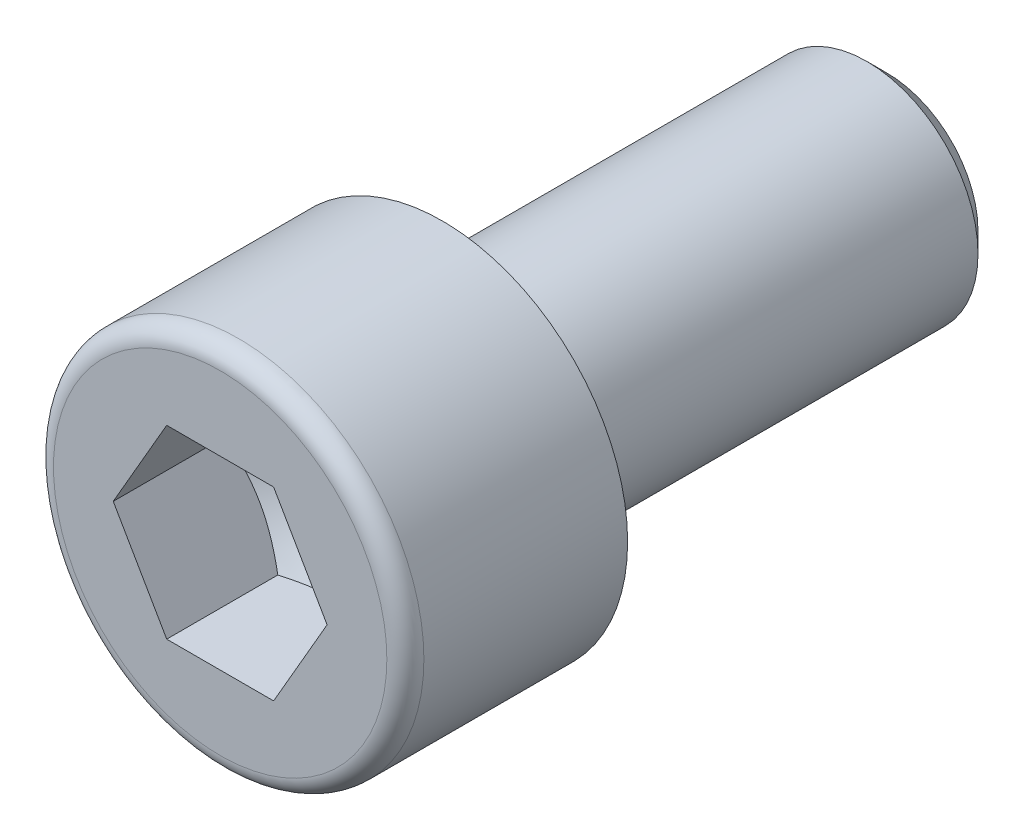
ISO-10303-21;
HEADER;
FILE_DESCRIPTION(('STEP AP214'),'2;1');
FILE_NAME('part.step','',(''),(''),'','','');
FILE_SCHEMA(('AUTOMOTIVE_DESIGN { 1 0 10303 214 1 1 1 1 }'));
ENDSEC;
DATA;
#1=APPLICATION_CONTEXT('core data for automotive mechanical design processes');
#2=APPLICATION_PROTOCOL_DEFINITION('international standard','automotive_design',2000,#1);
#3=PRODUCT_CONTEXT('',#1,'mechanical');
#4=PRODUCT('Part','Part','',(#3));
#5=PRODUCT_RELATED_PRODUCT_CATEGORY('part','',(#4));
#6=PRODUCT_DEFINITION_FORMATION('','',#4);
#7=PRODUCT_DEFINITION_CONTEXT('part definition',#1,'design');
#8=PRODUCT_DEFINITION('design','',#6,#7);
#9=PRODUCT_DEFINITION_SHAPE('','',#8);
#10=(LENGTH_UNIT() NAMED_UNIT(*) SI_UNIT(.MILLI.,.METRE.));
#11=(NAMED_UNIT(*) PLANE_ANGLE_UNIT() SI_UNIT($,.RADIAN.));
#12=(NAMED_UNIT(*) SI_UNIT($,.STERADIAN.) SOLID_ANGLE_UNIT());
#13=UNCERTAINTY_MEASURE_WITH_UNIT(LENGTH_MEASURE(1.E-05),#10,'distance_accuracy_value','');
#14=(GEOMETRIC_REPRESENTATION_CONTEXT(3) GLOBAL_UNCERTAINTY_ASSIGNED_CONTEXT((#13)) GLOBAL_UNIT_ASSIGNED_CONTEXT((#10,
#11,#12)) REPRESENTATION_CONTEXT('',''));
#15=CARTESIAN_POINT('',(0.,0.,0.));
#16=DIRECTION('',(0.,0.,1.));
#17=DIRECTION('',(1.,0.,0.));
#18=AXIS2_PLACEMENT_3D('',#15,#16,#17);
#19=CARTESIAN_POINT('',(0.,0.,6.));
#20=DIRECTION('',(0.,0.,1.));
#21=DIRECTION('',(1.,0.,0.));
#22=AXIS2_PLACEMENT_3D('',#19,#20,#21);
#23=PLANE('',#22);
#24=CARTESIAN_POINT('',(0.,0.,6.));
#25=DIRECTION('',(0.,0.,1.));
#26=DIRECTION('',(1.,0.,0.));
#27=AXIS2_PLACEMENT_3D('',#24,#25,#26);
#28=CIRCLE('',#27,4.5);
#29=CARTESIAN_POINT('',(4.5,0.,6.));
#30=VERTEX_POINT('',#29);
#31=EDGE_CURVE('E11',#30,#30,#28,.T.);
#32=ORIENTED_EDGE('',*,*,#31,.T.);
#33=EDGE_LOOP('',(#32));
#34=FACE_BOUND('',#33,.T.);
#35=DIRECTION('',(1.,0.,0.));
#36=VECTOR('',#35,1.);
#37=CARTESIAN_POINT('',(-1.443375,2.49999883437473,6.));
#38=LINE('',#37,#36);
#39=CARTESIAN_POINT('',(-1.443375,2.49999883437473,6.));
#40=VERTEX_POINT('',#39);
#41=CARTESIAN_POINT('',(1.443375,2.49999883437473,6.));
#42=VERTEX_POINT('',#41);
#43=EDGE_CURVE('E91',#40,#42,#38,.T.);
#44=ORIENTED_EDGE('',*,*,#43,.T.);
#45=DIRECTION('',(0.5,-0.866025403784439,0.));
#46=VECTOR('',#45,1.);
#47=CARTESIAN_POINT('',(1.443375,2.49999883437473,6.));
#48=LINE('',#47,#46);
#49=CARTESIAN_POINT('',(2.88675,0.,6.));
#50=VERTEX_POINT('',#49);
#51=EDGE_CURVE('E30',#42,#50,#48,.T.);
#52=ORIENTED_EDGE('',*,*,#51,.T.);
#53=DIRECTION('',(-0.5,-0.866025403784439,0.));
#54=VECTOR('',#53,1.);
#55=CARTESIAN_POINT('',(2.88675,0.,6.));
#56=LINE('',#55,#54);
#57=CARTESIAN_POINT('',(1.443375,-2.49999883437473,6.));
#58=VERTEX_POINT('',#57);
#59=EDGE_CURVE('E171',#50,#58,#56,.T.);
#60=ORIENTED_EDGE('',*,*,#59,.T.);
#61=DIRECTION('',(-1.,0.,0.));
#62=VECTOR('',#61,1.);
#63=CARTESIAN_POINT('',(1.443375,-2.49999883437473,6.));
#64=LINE('',#63,#62);
#65=CARTESIAN_POINT('',(-1.443375,-2.49999883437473,6.));
#66=VERTEX_POINT('',#65);
#67=EDGE_CURVE('E167',#58,#66,#64,.T.);
#68=ORIENTED_EDGE('',*,*,#67,.T.);
#69=DIRECTION('',(-0.5,0.866025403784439,0.));
#70=VECTOR('',#69,1.);
#71=CARTESIAN_POINT('',(-1.443375,-2.49999883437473,6.));
#72=LINE('',#71,#70);
#73=CARTESIAN_POINT('',(-2.88675,0.,6.));
#74=VERTEX_POINT('',#73);
#75=EDGE_CURVE('E162',#66,#74,#72,.T.);
#76=ORIENTED_EDGE('',*,*,#75,.T.);
#77=DIRECTION('',(0.5,0.866025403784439,0.));
#78=VECTOR('',#77,1.);
#79=CARTESIAN_POINT('',(-2.88675,0.,6.));
#80=LINE('',#79,#78);
#81=EDGE_CURVE('E95',#74,#40,#80,.T.);
#82=ORIENTED_EDGE('',*,*,#81,.T.);
#83=EDGE_LOOP('',(#44,#52,#60,#68,#76,#82));
#84=FACE_BOUND('',#83,.T.);
#85=ADVANCED_FACE('F16',(#34,#84),#23,.T.);
#86=CARTESIAN_POINT('',(0.,0.,5.5));
#87=DIRECTION('',(0.,0.,1.));
#88=DIRECTION('',(1.,0.,0.));
#89=AXIS2_PLACEMENT_3D('',#86,#87,#88);
#90=TOROIDAL_SURFACE('',#89,4.5,0.5);
#91=ORIENTED_EDGE('',*,*,#31,.F.);
#92=EDGE_LOOP('',(#91));
#93=FACE_BOUND('',#92,.T.);
#94=CARTESIAN_POINT('',(0.,0.,5.5));
#95=DIRECTION('',(0.,0.,1.));
#96=DIRECTION('',(1.,0.,0.));
#97=AXIS2_PLACEMENT_3D('',#94,#95,#96);
#98=CIRCLE('',#97,5.);
#99=CARTESIAN_POINT('',(5.,0.,5.5));
#100=VERTEX_POINT('',#99);
#101=EDGE_CURVE('E23',#100,#100,#98,.T.);
#102=ORIENTED_EDGE('',*,*,#101,.T.);
#103=EDGE_LOOP('',(#102));
#104=FACE_BOUND('',#103,.T.);
#105=ADVANCED_FACE('F132',(#93,#104),#90,.T.);
#106=CARTESIAN_POINT('',(0.,0.,6.));
#107=DIRECTION('',(0.,0.,1.));
#108=DIRECTION('',(1.,0.,0.));
#109=AXIS2_PLACEMENT_3D('',#106,#107,#108);
#110=CYLINDRICAL_SURFACE('',#109,5.);
#111=CARTESIAN_POINT('',(0.,0.,0.));
#112=DIRECTION('',(0.,0.,1.));
#113=DIRECTION('',(1.,0.,0.));
#114=AXIS2_PLACEMENT_3D('',#111,#112,#113);
#115=CIRCLE('',#114,5.);
#116=CARTESIAN_POINT('',(5.,0.,0.));
#117=VERTEX_POINT('',#116);
#118=EDGE_CURVE('E127',#117,#117,#115,.T.);
#119=ORIENTED_EDGE('',*,*,#118,.T.);
#120=EDGE_LOOP('',(#119));
#121=FACE_BOUND('',#120,.T.);
#122=ORIENTED_EDGE('',*,*,#101,.F.);
#123=EDGE_LOOP('',(#122));
#124=FACE_BOUND('',#123,.T.);
#125=ADVANCED_FACE('F134',(#121,#124),#110,.T.);
#126=CARTESIAN_POINT('',(0.,5.,0.));
#127=DIRECTION('',(0.,0.,-1.));
#128=DIRECTION('',(-1.,0.,0.));
#129=AXIS2_PLACEMENT_3D('',#126,#127,#128);
#130=PLANE('',#129);
#131=CARTESIAN_POINT('',(0.,0.,0.));
#132=DIRECTION('',(0.,0.,1.));
#133=DIRECTION('',(1.,0.,0.));
#134=AXIS2_PLACEMENT_3D('',#131,#132,#133);
#135=CIRCLE('',#134,3.3);
#136=CARTESIAN_POINT('',(3.3,0.,0.));
#137=VERTEX_POINT('',#136);
#138=EDGE_CURVE('E124',#137,#137,#135,.T.);
#139=ORIENTED_EDGE('',*,*,#138,.T.);
#140=EDGE_LOOP('',(#139));
#141=FACE_BOUND('',#140,.T.);
#142=ORIENTED_EDGE('',*,*,#118,.F.);
#143=EDGE_LOOP('',(#142));
#144=FACE_BOUND('',#143,.T.);
#145=ADVANCED_FACE('F136',(#141,#144),#130,.T.);
#146=CARTESIAN_POINT('',(0.,0.,-0.3));
#147=DIRECTION('',(0.,0.,1.));
#148=DIRECTION('',(1.,0.,0.));
#149=AXIS2_PLACEMENT_3D('',#146,#147,#148);
#150=TOROIDAL_SURFACE('',#149,3.3,0.3);
#151=CARTESIAN_POINT('',(0.,0.,-0.3));
#152=DIRECTION('',(0.,0.,1.));
#153=DIRECTION('',(1.,0.,0.));
#154=AXIS2_PLACEMENT_3D('',#151,#152,#153);
#155=CIRCLE('',#154,3.);
#156=CARTESIAN_POINT('',(3.,0.,-0.3));
#157=VERTEX_POINT('',#156);
#158=EDGE_CURVE('E121',#157,#157,#155,.T.);
#159=ORIENTED_EDGE('',*,*,#158,.T.);
#160=EDGE_LOOP('',(#159));
#161=FACE_BOUND('',#160,.T.);
#162=ORIENTED_EDGE('',*,*,#138,.F.);
#163=EDGE_LOOP('',(#162));
#164=FACE_BOUND('',#163,.T.);
#165=ADVANCED_FACE('F145',(#161,#164),#150,.F.);
#166=CARTESIAN_POINT('',(0.,0.,6.));
#167=DIRECTION('',(0.,0.,1.));
#168=DIRECTION('',(1.,0.,0.));
#169=AXIS2_PLACEMENT_3D('',#166,#167,#168);
#170=CYLINDRICAL_SURFACE('',#169,3.);
#171=CARTESIAN_POINT('',(0.,0.,-0.301));
#172=DIRECTION('',(0.,0.,1.));
#173=DIRECTION('',(1.,0.,0.));
#174=AXIS2_PLACEMENT_3D('',#171,#172,#173);
#175=CIRCLE('',#174,3.);
#176=CARTESIAN_POINT('',(3.,0.,-0.301));
#177=VERTEX_POINT('',#176);
#178=EDGE_CURVE('E118',#177,#177,#175,.T.);
#179=ORIENTED_EDGE('',*,*,#178,.T.);
#180=EDGE_LOOP('',(#179));
#181=FACE_BOUND('',#180,.T.);
#182=ORIENTED_EDGE('',*,*,#158,.F.);
#183=EDGE_LOOP('',(#182));
#184=FACE_BOUND('',#183,.T.);
#185=ADVANCED_FACE('F301',(#181,#184),#170,.T.);
#186=CARTESIAN_POINT('',(0.,0.,-0.301));
#187=DIRECTION('',(0.,0.,1.));
#188=DIRECTION('',(1.,0.,0.));
#189=AXIS2_PLACEMENT_3D('',#186,#187,#188);
#190=CONICAL_SURFACE('',#189,3.,0.523598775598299);
#191=CARTESIAN_POINT('',(0.,0.,-1.23847249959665));
#192=DIRECTION('',(0.,0.,1.));
#193=DIRECTION('',(1.,0.,0.));
#194=AXIS2_PLACEMENT_3D('',#191,#192,#193);
#195=CIRCLE('',#194,2.45875);
#196=CARTESIAN_POINT('',(2.45875,0.,-1.23847249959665));
#197=VERTEX_POINT('',#196);
#198=EDGE_CURVE('E115',#197,#197,#195,.T.);
#199=ORIENTED_EDGE('',*,*,#198,.T.);
#200=EDGE_LOOP('',(#199));
#201=FACE_BOUND('',#200,.T.);
#202=ORIENTED_EDGE('',*,*,#178,.F.);
#203=EDGE_LOOP('',(#202));
#204=FACE_BOUND('',#203,.T.);
#205=ADVANCED_FACE('F314',(#201,#204),#190,.T.);
#206=CARTESIAN_POINT('',(0.,2.45875,-1.23847249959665));
#207=DIRECTION('',(0.,0.,1.));
#208=DIRECTION('',(1.,0.,0.));
#209=AXIS2_PLACEMENT_3D('',#206,#207,#208);
#210=PLANE('',#209);
#211=CARTESIAN_POINT('',(0.,0.,-1.23847249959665));
#212=DIRECTION('',(0.,0.,1.));
#213=DIRECTION('',(1.,0.,0.));
#214=AXIS2_PLACEMENT_3D('',#211,#212,#213);
#215=CIRCLE('',#214,3.);
#216=CARTESIAN_POINT('',(3.,0.,-1.23847249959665));
#217=VERTEX_POINT('',#216);
#218=EDGE_CURVE('E112',#217,#217,#215,.T.);
#219=ORIENTED_EDGE('',*,*,#218,.T.);
#220=EDGE_LOOP('',(#219));
#221=FACE_BOUND('',#220,.T.);
#222=ORIENTED_EDGE('',*,*,#198,.F.);
#223=EDGE_LOOP('',(#222));
#224=FACE_BOUND('',#223,.T.);
#225=ADVANCED_FACE('F327',(#221,#224),#210,.T.);
#226=CARTESIAN_POINT('',(0.,0.,6.));
#227=DIRECTION('',(0.,0.,1.));
#228=DIRECTION('',(1.,0.,0.));
#229=AXIS2_PLACEMENT_3D('',#226,#227,#228);
#230=CYLINDRICAL_SURFACE('',#229,3.);
#231=CARTESIAN_POINT('',(0.,0.,-11.45875));
#232=DIRECTION('',(0.,0.,1.));
#233=DIRECTION('',(1.,0.,0.));
#234=AXIS2_PLACEMENT_3D('',#231,#232,#233);
#235=CIRCLE('',#234,3.);
#236=CARTESIAN_POINT('',(3.,0.,-11.45875));
#237=VERTEX_POINT('',#236);
#238=EDGE_CURVE('E109',#237,#237,#235,.T.);
#239=ORIENTED_EDGE('',*,*,#238,.T.);
#240=EDGE_LOOP('',(#239));
#241=FACE_BOUND('',#240,.T.);
#242=ORIENTED_EDGE('',*,*,#218,.F.);
#243=EDGE_LOOP('',(#242));
#244=FACE_BOUND('',#243,.T.);
#245=ADVANCED_FACE('F340',(#241,#244),#230,.T.);
#246=CARTESIAN_POINT('',(0.,0.,-11.45875));
#247=DIRECTION('',(0.,0.,1.));
#248=DIRECTION('',(1.,0.,0.));
#249=AXIS2_PLACEMENT_3D('',#246,#247,#248);
#250=CONICAL_SURFACE('',#249,3.,0.78539816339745);
#251=CARTESIAN_POINT('',(0.,0.,-12.));
#252=DIRECTION('',(0.,0.,1.));
#253=DIRECTION('',(1.,0.,0.));
#254=AXIS2_PLACEMENT_3D('',#251,#252,#253);
#255=CIRCLE('',#254,2.45875);
#256=CARTESIAN_POINT('',(2.45875,0.,-12.));
#257=VERTEX_POINT('',#256);
#258=EDGE_CURVE('E106',#257,#257,#255,.T.);
#259=ORIENTED_EDGE('',*,*,#258,.T.);
#260=EDGE_LOOP('',(#259));
#261=FACE_BOUND('',#260,.T.);
#262=ORIENTED_EDGE('',*,*,#238,.F.);
#263=EDGE_LOOP('',(#262));
#264=FACE_BOUND('',#263,.T.);
#265=ADVANCED_FACE('F353',(#261,#264),#250,.T.);
#266=CARTESIAN_POINT('',(0.,2.45875,-12.));
#267=DIRECTION('',(0.,0.,-1.));
#268=DIRECTION('',(-1.,0.,0.));
#269=AXIS2_PLACEMENT_3D('',#266,#267,#268);
#270=PLANE('',#269);
#271=ORIENTED_EDGE('',*,*,#258,.F.);
#272=EDGE_LOOP('',(#271));
#273=FACE_BOUND('',#272,.T.);
#274=ADVANCED_FACE('F228',(#273),#270,.T.);
#275=CARTESIAN_POINT('',(1.443375,2.49999883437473,1.33333411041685));
#276=DIRECTION('',(-0.866025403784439,-0.5,0.));
#277=DIRECTION('',(-0.5,0.866025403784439,0.));
#278=AXIS2_PLACEMENT_3D('',#275,#276,#277);
#279=PLANE('',#278);
#280=DIRECTION('',(0.,0.,1.));
#281=VECTOR('',#280,1.);
#282=CARTESIAN_POINT('',(2.88675,0.,1.33333411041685));
#283=LINE('',#282,#281);
#284=CARTESIAN_POINT('',(2.88675,0.,3.));
#285=VERTEX_POINT('',#284);
#286=EDGE_CURVE('E104',#285,#50,#283,.T.);
#287=ORIENTED_EDGE('',*,*,#286,.T.);
#288=ORIENTED_EDGE('',*,*,#51,.F.);
#289=DIRECTION('',(0.,0.,1.));
#290=VECTOR('',#289,1.);
#291=CARTESIAN_POINT('',(1.443375,2.49999883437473,1.33333411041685));
#292=LINE('',#291,#290);
#293=CARTESIAN_POINT('',(1.443375,2.49999883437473,3.));
#294=VERTEX_POINT('',#293);
#295=EDGE_CURVE('E85',#294,#42,#292,.T.);
#296=ORIENTED_EDGE('',*,*,#295,.F.);
#297=CARTESIAN_POINT('',(2.88675011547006,-1.99999999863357E-07,3.00000006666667));
#298=CARTESIAN_POINT('',(2.82332252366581,0.10985961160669,2.96336950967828));
#299=CARTESIAN_POINT('',(2.75934742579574,0.220667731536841,2.93005593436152));
#300=CARTESIAN_POINT('',(2.63028954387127,0.444202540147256,2.87190808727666));
#301=CARTESIAN_POINT('',(2.56520446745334,0.556933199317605,2.84709438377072));
#302=CARTESIAN_POINT('',(2.43584088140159,0.780997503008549,2.80847006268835));
#303=CARTESIAN_POINT('',(2.37158227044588,0.892296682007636,2.7944023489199));
#304=CARTESIAN_POINT('',(2.24276284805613,1.11541846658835,2.77761157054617));
#305=CARTESIAN_POINT('',(2.17820250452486,1.22724026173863,2.77487459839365));
#306=CARTESIAN_POINT('',(2.05757841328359,1.43616731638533,2.78058295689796));
#307=CARTESIAN_POINT('',(2.00149656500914,1.53330392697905,2.7876266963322));
#308=CARTESIAN_POINT('',(1.8896982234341,1.72694433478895,2.80994670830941));
#309=CARTESIAN_POINT('',(1.83398211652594,1.82344746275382,2.82523059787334));
#310=CARTESIAN_POINT('',(1.72195345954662,2.01748678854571,2.86343736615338));
#311=CARTESIAN_POINT('',(1.66565508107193,2.11499844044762,2.88652212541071));
#312=CARTESIAN_POINT('',(1.55389777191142,2.3085677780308,2.93891477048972));
#313=CARTESIAN_POINT('',(1.49843741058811,2.40462794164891,2.96821035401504));
#314=CARTESIAN_POINT('',(1.44337488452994,2.49999903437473,3.00000006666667));
#315=B_SPLINE_CURVE_WITH_KNOTS('',3,(#297,#298,#299,#300,#301,#302,#303,#304,#305,#306,#307,
#308,#309,#310,#311,#312,#313,#314),.UNSPECIFIED.,.F.,.F.,(4,2,2,2,2,2,2,2,4),(0.,
0.396269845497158,0.793491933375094,1.18088400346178,1.56780044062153,1.90463400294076,
2.24177946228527,2.58640119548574,2.93034658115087),.UNSPECIFIED.);
#316=EDGE_CURVE('E78',#285,#294,#315,.T.);
#317=ORIENTED_EDGE('',*,*,#316,.F.);
#318=EDGE_LOOP('',(#287,#288,#296,#317));
#319=FACE_BOUND('',#318,.T.);
#320=ADVANCED_FACE('F86',(#319),#279,.T.);
#321=CARTESIAN_POINT('',(2.88675,0.,1.33333411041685));
#322=DIRECTION('',(-0.866025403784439,0.5,0.));
#323=DIRECTION('',(0.5,0.866025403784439,0.));
#324=AXIS2_PLACEMENT_3D('',#321,#322,#323);
#325=PLANE('',#324);
#326=DIRECTION('',(0.,0.,1.));
#327=VECTOR('',#326,1.);
#328=CARTESIAN_POINT('',(1.443375,-2.49999883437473,1.33333411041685));
#329=LINE('',#328,#327);
#330=CARTESIAN_POINT('',(1.443375,-2.49999883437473,3.));
#331=VERTEX_POINT('',#330);
#332=EDGE_CURVE('E102',#331,#58,#329,.T.);
#333=ORIENTED_EDGE('',*,*,#332,.T.);
#334=ORIENTED_EDGE('',*,*,#59,.F.);
#335=ORIENTED_EDGE('',*,*,#286,.F.);
#336=CARTESIAN_POINT('',(1.44337488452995,-2.49999903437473,3.00000006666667));
#337=CARTESIAN_POINT('',(1.50680247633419,-2.39013922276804,2.96336950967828));
#338=CARTESIAN_POINT('',(1.57077757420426,-2.27933110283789,2.93005593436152));
#339=CARTESIAN_POINT('',(1.69983545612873,-2.05579629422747,2.87190808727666));
#340=CARTESIAN_POINT('',(1.76492053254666,-1.94306563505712,2.84709438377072));
#341=CARTESIAN_POINT('',(1.89428411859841,-1.71900133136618,2.80847006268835));
#342=CARTESIAN_POINT('',(1.95854272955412,-1.60770215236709,2.7944023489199));
#343=CARTESIAN_POINT('',(2.08736215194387,-1.38458036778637,2.77761157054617));
#344=CARTESIAN_POINT('',(2.15192249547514,-1.2727585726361,2.77487459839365));
#345=CARTESIAN_POINT('',(2.27254658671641,-1.06383151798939,2.78058295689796));
#346=CARTESIAN_POINT('',(2.32862843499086,-0.96669490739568,2.7876266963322));
#347=CARTESIAN_POINT('',(2.4404267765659,-0.773054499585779,2.8099467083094));
#348=CARTESIAN_POINT('',(2.49614288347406,-0.676551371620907,2.82523059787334));
#349=CARTESIAN_POINT('',(2.60817154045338,-0.48251204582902,2.86343736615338));
#350=CARTESIAN_POINT('',(2.66446991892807,-0.385000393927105,2.88652212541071));
#351=CARTESIAN_POINT('',(2.77622722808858,-0.191431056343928,2.93891477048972));
#352=CARTESIAN_POINT('',(2.83168758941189,-0.0953708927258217,2.96821035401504));
#353=CARTESIAN_POINT('',(2.88675011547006,1.99999999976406E-07,3.00000006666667));
#354=B_SPLINE_CURVE_WITH_KNOTS('',3,(#336,#337,#338,#339,#340,#341,#342,#343,#344,#345,#346,
#347,#348,#349,#350,#351,#352,#353),.UNSPECIFIED.,.F.,.F.,(4,2,2,2,2,2,2,2,4),(0.,
0.396269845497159,0.793491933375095,1.18088400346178,1.56780044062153,1.90463400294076,
2.24177946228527,2.58640119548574,2.93034658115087),.UNSPECIFIED.);
#355=EDGE_CURVE('E82',#331,#285,#354,.T.);
#356=ORIENTED_EDGE('',*,*,#355,.F.);
#357=EDGE_LOOP('',(#333,#334,#335,#356));
#358=FACE_BOUND('',#357,.T.);
#359=ADVANCED_FACE('F218',(#358),#325,.T.);
#360=CARTESIAN_POINT('',(1.443375,-2.49999883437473,1.33333411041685));
#361=DIRECTION('',(0.,1.,0.));
#362=DIRECTION('',(1.,0.,0.));
#363=AXIS2_PLACEMENT_3D('',#360,#361,#362);
#364=PLANE('',#363);
#365=DIRECTION('',(0.,0.,1.));
#366=VECTOR('',#365,1.);
#367=CARTESIAN_POINT('',(-1.443375,-2.49999883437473,1.33333411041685));
#368=LINE('',#367,#366);
#369=CARTESIAN_POINT('',(-1.443375,-2.49999883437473,3.));
#370=VERTEX_POINT('',#369);
#371=EDGE_CURVE('E100',#370,#66,#368,.T.);
#372=ORIENTED_EDGE('',*,*,#371,.T.);
#373=ORIENTED_EDGE('',*,*,#67,.F.);
#374=ORIENTED_EDGE('',*,*,#332,.F.);
#375=CARTESIAN_POINT('',(-3.73786106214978,-2.49999883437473,3.92958778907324));
#376=CARTESIAN_POINT('',(-3.62990250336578,-2.49999883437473,3.87779335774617));
#377=CARTESIAN_POINT('',(-3.52168094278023,-2.49999883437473,3.82653690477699));
#378=CARTESIAN_POINT('',(-3.30457164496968,-2.49999883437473,3.72540514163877));
#379=CARTESIAN_POINT('',(-3.19568379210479,-2.49999883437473,3.67553008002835));
#380=CARTESIAN_POINT('',(-2.97647740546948,-2.49999883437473,3.57718765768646));
#381=CARTESIAN_POINT('',(-2.86615419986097,-2.49999883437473,3.52873067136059));
#382=CARTESIAN_POINT('',(-2.64458202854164,-2.49999883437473,3.4339896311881));
#383=CARTESIAN_POINT('',(-2.5333331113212,-2.49999883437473,3.38770546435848));
#384=CARTESIAN_POINT('',(-2.30680205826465,-2.49999883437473,3.29671007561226));
#385=CARTESIAN_POINT('',(-2.19149052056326,-2.49999883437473,3.25207161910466));
#386=CARTESIAN_POINT('',(-1.95947266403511,-2.49999883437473,3.16650598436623));
#387=CARTESIAN_POINT('',(-1.84276618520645,-2.49999883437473,3.12557923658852));
#388=CARTESIAN_POINT('',(-1.60804233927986,-2.49999883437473,3.04860739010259));
#389=CARTESIAN_POINT('',(-1.49002871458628,-2.49999883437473,3.01255100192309));
#390=CARTESIAN_POINT('',(-1.25231014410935,-2.49999883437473,2.94655294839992));
#391=CARTESIAN_POINT('',(-1.13260562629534,-2.49999883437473,2.91660976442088));
#392=CARTESIAN_POINT('',(-0.891754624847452,-2.49999883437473,2.86443431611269));
#393=CARTESIAN_POINT('',(-0.770611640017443,-2.49999883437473,2.84218621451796));
#394=CARTESIAN_POINT('',(-0.526970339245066,-2.49999883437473,2.80685777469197));
#395=CARTESIAN_POINT('',(-0.404472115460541,-2.49999883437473,2.79377681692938));
#396=CARTESIAN_POINT('',(-0.160266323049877,-2.49999883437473,2.77799632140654));
#397=CARTESIAN_POINT('',(-0.0385668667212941,-2.49999883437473,2.77517427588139));
#398=CARTESIAN_POINT('',(0.204641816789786,-2.49999883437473,2.77983589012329));
#399=CARTESIAN_POINT('',(0.326151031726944,-2.49999883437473,2.78732018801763));
#400=CARTESIAN_POINT('',(0.536550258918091,-2.49999883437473,2.80869871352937));
#401=CARTESIAN_POINT('',(0.62567290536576,-2.49999883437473,2.82040889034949));
#402=CARTESIAN_POINT('',(0.803172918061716,-2.49999883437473,2.84856827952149));
#403=CARTESIAN_POINT('',(0.891550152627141,-2.49999883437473,2.86501831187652));
#404=CARTESIAN_POINT('',(1.15551819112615,-2.49999883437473,2.92060817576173));
#405=CARTESIAN_POINT('',(1.32980784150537,-2.49999883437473,2.96597208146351));
#406=CARTESIAN_POINT('',(1.59042319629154,-2.49999883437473,3.04347409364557));
#407=CARTESIAN_POINT('',(1.67812270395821,-2.49999883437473,3.07124565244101));
#408=CARTESIAN_POINT('',(1.85261386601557,-2.49999883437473,3.12935698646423));
#409=CARTESIAN_POINT('',(1.93940604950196,-2.49999883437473,3.15969515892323));
#410=CARTESIAN_POINT('',(2.11219208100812,-2.49999883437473,3.22250012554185));
#411=CARTESIAN_POINT('',(2.19818607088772,-2.49999883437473,3.25496653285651));
#412=CARTESIAN_POINT('',(2.36949689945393,-2.49999883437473,3.32167630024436));
#413=CARTESIAN_POINT('',(2.45481362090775,-2.49999883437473,3.3559199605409));
#414=CARTESIAN_POINT('',(2.67258663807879,-2.49999883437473,3.44552247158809));
#415=CARTESIAN_POINT('',(2.80460718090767,-2.49999883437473,3.50193902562));
#416=CARTESIAN_POINT('',(3.06745885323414,-2.49999883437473,3.61748625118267));
#417=CARTESIAN_POINT('',(3.19828989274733,-2.49999883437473,3.67661712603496));
#418=CARTESIAN_POINT('',(3.45900849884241,-2.49999883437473,3.79697660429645));
#419=CARTESIAN_POINT('',(3.58889589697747,-2.49999883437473,3.85820557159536));
#420=CARTESIAN_POINT('',(3.84788845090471,-2.49999883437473,3.98229868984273));
#421=CARTESIAN_POINT('',(3.97699358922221,-2.49999883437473,4.04516287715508));
#422=CARTESIAN_POINT('',(4.36366789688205,-2.49999883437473,4.2358316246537));
#423=CARTESIAN_POINT('',(4.62028438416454,-2.49999883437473,4.36556637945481));
#424=CARTESIAN_POINT('',(5.1317603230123,-2.49999883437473,4.62835381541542));
#425=CARTESIAN_POINT('',(5.38661999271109,-2.49999883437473,4.76140607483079));
#426=CARTESIAN_POINT('',(5.87112445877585,-2.49999883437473,5.01714627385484));
#427=CARTESIAN_POINT('',(6.10087872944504,-2.49999883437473,5.13962714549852));
#428=CARTESIAN_POINT('',(6.5596482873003,-2.49999883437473,5.3859833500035));
#429=CARTESIAN_POINT('',(6.78866354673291,-2.49999883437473,5.5098587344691));
#430=CARTESIAN_POINT('',(7.24554286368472,-2.49999883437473,5.75833893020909));
#431=CARTESIAN_POINT('',(7.47340836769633,-2.49999883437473,5.88294108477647));
#432=CARTESIAN_POINT('',(7.92867868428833,-2.49999883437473,6.13295637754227));
#433=CARTESIAN_POINT('',(8.15608352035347,-2.49999883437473,6.25836947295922));
#434=CARTESIAN_POINT('',(8.38332285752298,-2.49999883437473,6.38407980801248));
#435=B_SPLINE_CURVE_WITH_KNOTS('',3,(#375,#376,#377,#378,#379,#380,#381,#382,#383,#384,#385,
#386,#387,#388,#389,#390,#391,#392,#393,#394,#395,#396,#397,#398,#399,#400,#401,#402,#403,#404,
#405,#406,#407,#408,#409,#410,#411,#412,#413,#414,#415,#416,#417,#418,#419,#420,#421,#422,#423,
#424,#425,#426,#427,#428,#429,#430,#431,#432,#433,#434),.UNSPECIFIED.,.F.,.F.,(4,2,2,2,2,2,2,2,
2,2,2,2,2,2,2,2,2,2,2,2,2,2,2,2,2,2,2,2,2,4),(0.,0.359225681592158,0.718515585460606,
1.07998495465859,1.44143550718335,1.81233642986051,2.18328031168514,2.55334902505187,
2.92332569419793,3.29253631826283,3.66172198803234,4.02648423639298,4.39126907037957,
4.66080188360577,4.93038135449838,5.46995360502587,5.74590907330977,6.02169347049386,
6.29742787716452,6.5732090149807,7.00387398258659,7.43457126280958,7.86534362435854,
8.29612557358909,9.15872149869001,10.0212083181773,10.8022890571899,11.583398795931,
12.3625217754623,13.1416039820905),.UNSPECIFIED.);
#436=EDGE_CURVE('E209',#370,#331,#435,.T.);
#437=ORIENTED_EDGE('',*,*,#436,.F.);
#438=EDGE_LOOP('',(#372,#373,#374,#437));
#439=FACE_BOUND('',#438,.T.);
#440=ADVANCED_FACE('F214',(#439),#364,.T.);
#441=CARTESIAN_POINT('',(-1.443375,-2.49999883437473,1.33333411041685));
#442=DIRECTION('',(0.866025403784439,0.5,0.));
#443=DIRECTION('',(0.5,-0.866025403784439,0.));
#444=AXIS2_PLACEMENT_3D('',#441,#442,#443);
#445=PLANE('',#444);
#446=DIRECTION('',(0.,0.,1.));
#447=VECTOR('',#446,1.);
#448=CARTESIAN_POINT('',(-2.88675,0.,1.33333411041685));
#449=LINE('',#448,#447);
#450=CARTESIAN_POINT('',(-2.88675,0.,3.));
#451=VERTEX_POINT('',#450);
#452=EDGE_CURVE('E93',#451,#74,#449,.T.);
#453=ORIENTED_EDGE('',*,*,#452,.T.);
#454=ORIENTED_EDGE('',*,*,#75,.F.);
#455=ORIENTED_EDGE('',*,*,#371,.F.);
#456=CARTESIAN_POINT('',(-2.88675011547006,2.E-07,3.00000006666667));
#457=CARTESIAN_POINT('',(-2.82332252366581,-0.109859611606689,2.96336950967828));
#458=CARTESIAN_POINT('',(-2.75934742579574,-0.220667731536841,2.93005593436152));
#459=CARTESIAN_POINT('',(-2.63028954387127,-0.444202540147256,2.87190808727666));
#460=CARTESIAN_POINT('',(-2.56520446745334,-0.556933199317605,2.84709438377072));
#461=CARTESIAN_POINT('',(-2.43584088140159,-0.78099750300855,2.80847006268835));
#462=CARTESIAN_POINT('',(-2.37158227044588,-0.892296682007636,2.7944023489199));
#463=CARTESIAN_POINT('',(-2.24276284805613,-1.11541846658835,2.77761157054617));
#464=CARTESIAN_POINT('',(-2.17820250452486,-1.22724026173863,2.77487459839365));
#465=CARTESIAN_POINT('',(-2.05757841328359,-1.43616731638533,2.78058295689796));
#466=CARTESIAN_POINT('',(-2.00149656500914,-1.53330392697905,2.7876266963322));
#467=CARTESIAN_POINT('',(-1.8896982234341,-1.72694433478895,2.80994670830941));
#468=CARTESIAN_POINT('',(-1.83398211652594,-1.82344746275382,2.82523059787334));
#469=CARTESIAN_POINT('',(-1.72195345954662,-2.01748678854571,2.86343736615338));
#470=CARTESIAN_POINT('',(-1.66565508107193,-2.11499844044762,2.88652212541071));
#471=CARTESIAN_POINT('',(-1.55389777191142,-2.3085677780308,2.93891477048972));
#472=CARTESIAN_POINT('',(-1.49843741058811,-2.40462794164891,2.96821035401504));
#473=CARTESIAN_POINT('',(-1.44337488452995,-2.49999903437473,3.00000006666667));
#474=B_SPLINE_CURVE_WITH_KNOTS('',3,(#456,#457,#458,#459,#460,#461,#462,#463,#464,#465,#466,
#467,#468,#469,#470,#471,#472,#473),.UNSPECIFIED.,.F.,.F.,(4,2,2,2,2,2,2,2,4),(0.,
0.396269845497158,0.793491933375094,1.18088400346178,1.56780044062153,1.90463400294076,
2.24177946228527,2.58640119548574,2.93034658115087),.UNSPECIFIED.);
#475=EDGE_CURVE('E204',#451,#370,#474,.T.);
#476=ORIENTED_EDGE('',*,*,#475,.F.);
#477=EDGE_LOOP('',(#453,#454,#455,#476));
#478=FACE_BOUND('',#477,.T.);
#479=ADVANCED_FACE('F217',(#478),#445,.T.);
#480=CARTESIAN_POINT('',(-2.88675,0.,1.33333411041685));
#481=DIRECTION('',(0.866025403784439,-0.5,0.));
#482=DIRECTION('',(-0.5,-0.866025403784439,0.));
#483=AXIS2_PLACEMENT_3D('',#480,#481,#482);
#484=PLANE('',#483);
#485=DIRECTION('',(0.,0.,1.));
#486=VECTOR('',#485,1.);
#487=CARTESIAN_POINT('',(-1.443375,2.49999883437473,1.33333411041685));
#488=LINE('',#487,#486);
#489=CARTESIAN_POINT('',(-1.443375,2.49999883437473,3.));
#490=VERTEX_POINT('',#489);
#491=EDGE_CURVE('E90',#490,#40,#488,.T.);
#492=ORIENTED_EDGE('',*,*,#491,.T.);
#493=ORIENTED_EDGE('',*,*,#81,.F.);
#494=ORIENTED_EDGE('',*,*,#452,.F.);
#495=CARTESIAN_POINT('',(-1.44337488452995,2.49999903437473,3.00000006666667));
#496=CARTESIAN_POINT('',(-1.50680247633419,2.39013922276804,2.96336950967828));
#497=CARTESIAN_POINT('',(-1.57077757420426,2.27933110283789,2.93005593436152));
#498=CARTESIAN_POINT('',(-1.69983545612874,2.05579629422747,2.87190808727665));
#499=CARTESIAN_POINT('',(-1.76492053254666,1.94306563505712,2.84709438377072));
#500=CARTESIAN_POINT('',(-1.89428411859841,1.71900133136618,2.80847006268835));
#501=CARTESIAN_POINT('',(-1.95854272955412,1.60770215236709,2.7944023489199));
#502=CARTESIAN_POINT('',(-2.08736215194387,1.38458036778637,2.77761157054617));
#503=CARTESIAN_POINT('',(-2.15192249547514,1.2727585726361,2.77487459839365));
#504=CARTESIAN_POINT('',(-2.27254658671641,1.06383151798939,2.78058295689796));
#505=CARTESIAN_POINT('',(-2.32862843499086,0.966694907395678,2.7876266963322));
#506=CARTESIAN_POINT('',(-2.4404267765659,0.773054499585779,2.8099467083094));
#507=CARTESIAN_POINT('',(-2.49614288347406,0.676551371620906,2.82523059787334));
#508=CARTESIAN_POINT('',(-2.60817154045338,0.48251204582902,2.86343736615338));
#509=CARTESIAN_POINT('',(-2.66446991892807,0.385000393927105,2.88652212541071));
#510=CARTESIAN_POINT('',(-2.77622722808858,0.191431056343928,2.93891477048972));
#511=CARTESIAN_POINT('',(-2.83168758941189,0.0953708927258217,2.96821035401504));
#512=CARTESIAN_POINT('',(-2.88675011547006,-2.00000000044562E-07,3.00000006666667));
#513=B_SPLINE_CURVE_WITH_KNOTS('',3,(#495,#496,#497,#498,#499,#500,#501,#502,#503,#504,#505,
#506,#507,#508,#509,#510,#511,#512),.UNSPECIFIED.,.F.,.F.,(4,2,2,2,2,2,2,2,4),(0.,
0.396269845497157,0.793491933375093,1.18088400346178,1.56780044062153,1.90463400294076,
2.24177946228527,2.58640119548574,2.93034658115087),.UNSPECIFIED.);
#514=EDGE_CURVE('E38',#490,#451,#513,.T.);
#515=ORIENTED_EDGE('',*,*,#514,.F.);
#516=EDGE_LOOP('',(#492,#493,#494,#515));
#517=FACE_BOUND('',#516,.T.);
#518=ADVANCED_FACE('F161',(#517),#484,.T.);
#519=CARTESIAN_POINT('',(-1.443375,2.49999883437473,1.33333411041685));
#520=DIRECTION('',(0.,-1.,0.));
#521=DIRECTION('',(-1.,0.,0.));
#522=AXIS2_PLACEMENT_3D('',#519,#520,#521);
#523=PLANE('',#522);
#524=ORIENTED_EDGE('',*,*,#295,.T.);
#525=ORIENTED_EDGE('',*,*,#43,.F.);
#526=ORIENTED_EDGE('',*,*,#491,.F.);
#527=CARTESIAN_POINT('',(-3.73786106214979,2.49999883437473,3.92958778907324));
#528=CARTESIAN_POINT('',(-3.62990250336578,2.49999883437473,3.87779335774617));
#529=CARTESIAN_POINT('',(-3.52168094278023,2.49999883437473,3.82653690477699));
#530=CARTESIAN_POINT('',(-3.30457164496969,2.49999883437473,3.72540514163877));
#531=CARTESIAN_POINT('',(-3.1956837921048,2.49999883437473,3.67553008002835));
#532=CARTESIAN_POINT('',(-2.97647740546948,2.49999883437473,3.57718765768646));
#533=CARTESIAN_POINT('',(-2.86615419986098,2.49999883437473,3.5287306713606));
#534=CARTESIAN_POINT('',(-2.64458202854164,2.49999883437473,3.43398963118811));
#535=CARTESIAN_POINT('',(-2.53333311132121,2.49999883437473,3.38770546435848));
#536=CARTESIAN_POINT('',(-2.30680205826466,2.49999883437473,3.29671007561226));
#537=CARTESIAN_POINT('',(-2.19149052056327,2.49999883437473,3.25207161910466));
#538=CARTESIAN_POINT('',(-1.95947266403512,2.49999883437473,3.16650598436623));
#539=CARTESIAN_POINT('',(-1.84276618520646,2.49999883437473,3.12557923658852));
#540=CARTESIAN_POINT('',(-1.60804233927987,2.49999883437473,3.04860739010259));
#541=CARTESIAN_POINT('',(-1.49002871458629,2.49999883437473,3.01255100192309));
#542=CARTESIAN_POINT('',(-1.25231014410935,2.49999883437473,2.94655294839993));
#543=CARTESIAN_POINT('',(-1.13260562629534,2.49999883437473,2.91660976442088));
#544=CARTESIAN_POINT('',(-0.891754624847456,2.49999883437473,2.86443431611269));
#545=CARTESIAN_POINT('',(-0.770611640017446,2.49999883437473,2.84218621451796));
#546=CARTESIAN_POINT('',(-0.526970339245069,2.49999883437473,2.80685777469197));
#547=CARTESIAN_POINT('',(-0.404472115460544,2.49999883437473,2.79377681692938));
#548=CARTESIAN_POINT('',(-0.160266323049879,2.49999883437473,2.77799632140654));
#549=CARTESIAN_POINT('',(-0.0385668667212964,2.49999883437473,2.77517427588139));
#550=CARTESIAN_POINT('',(0.204641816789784,2.49999883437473,2.77983589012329));
#551=CARTESIAN_POINT('',(0.326151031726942,2.49999883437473,2.78732018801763));
#552=CARTESIAN_POINT('',(0.536550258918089,2.49999883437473,2.80869871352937));
#553=CARTESIAN_POINT('',(0.625672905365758,2.49999883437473,2.82040889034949));
#554=CARTESIAN_POINT('',(0.803172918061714,2.49999883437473,2.84856827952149));
#555=CARTESIAN_POINT('',(0.891550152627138,2.49999883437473,2.86501831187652));
#556=CARTESIAN_POINT('',(1.15551819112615,2.49999883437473,2.92060817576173));
#557=CARTESIAN_POINT('',(1.32980784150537,2.49999883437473,2.96597208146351));
#558=CARTESIAN_POINT('',(1.59042319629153,2.49999883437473,3.04347409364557));
#559=CARTESIAN_POINT('',(1.67812270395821,2.49999883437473,3.07124565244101));
#560=CARTESIAN_POINT('',(1.85261386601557,2.49999883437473,3.12935698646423));
#561=CARTESIAN_POINT('',(1.93940604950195,2.49999883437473,3.15969515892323));
#562=CARTESIAN_POINT('',(2.11219208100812,2.49999883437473,3.22250012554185));
#563=CARTESIAN_POINT('',(2.19818607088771,2.49999883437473,3.25496653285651));
#564=CARTESIAN_POINT('',(2.36949689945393,2.49999883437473,3.32167630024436));
#565=CARTESIAN_POINT('',(2.45481362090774,2.49999883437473,3.3559199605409));
#566=CARTESIAN_POINT('',(2.67258663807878,2.49999883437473,3.44552247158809));
#567=CARTESIAN_POINT('',(2.80460718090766,2.49999883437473,3.50193902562));
#568=CARTESIAN_POINT('',(3.06745885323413,2.49999883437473,3.61748625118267));
#569=CARTESIAN_POINT('',(3.19828989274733,2.49999883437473,3.67661712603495));
#570=CARTESIAN_POINT('',(3.45900849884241,2.49999883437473,3.79697660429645));
#571=CARTESIAN_POINT('',(3.58889589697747,2.49999883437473,3.85820557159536));
#572=CARTESIAN_POINT('',(3.84788845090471,2.49999883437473,3.98229868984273));
#573=CARTESIAN_POINT('',(3.97699358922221,2.49999883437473,4.04516287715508));
#574=CARTESIAN_POINT('',(4.36366789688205,2.49999883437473,4.2358316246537));
#575=CARTESIAN_POINT('',(4.62028438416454,2.49999883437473,4.36556637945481));
#576=CARTESIAN_POINT('',(5.1317603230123,2.49999883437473,4.62835381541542));
#577=CARTESIAN_POINT('',(5.38661999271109,2.49999883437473,4.76140607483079));
#578=CARTESIAN_POINT('',(5.87112445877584,2.49999883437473,5.01714627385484));
#579=CARTESIAN_POINT('',(6.10087872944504,2.49999883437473,5.13962714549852));
#580=CARTESIAN_POINT('',(6.5596482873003,2.49999883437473,5.3859833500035));
#581=CARTESIAN_POINT('',(6.7886635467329,2.49999883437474,5.5098587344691));
#582=CARTESIAN_POINT('',(7.24554286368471,2.49999883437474,5.75833893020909));
#583=CARTESIAN_POINT('',(7.47340836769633,2.49999883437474,5.88294108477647));
#584=CARTESIAN_POINT('',(7.92867868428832,2.49999883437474,6.13295637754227));
#585=CARTESIAN_POINT('',(8.15608352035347,2.49999883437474,6.25836947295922));
#586=CARTESIAN_POINT('',(8.38332285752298,2.49999883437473,6.38407980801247));
#587=B_SPLINE_CURVE_WITH_KNOTS('',3,(#527,#528,#529,#530,#531,#532,#533,#534,#535,#536,#537,
#538,#539,#540,#541,#542,#543,#544,#545,#546,#547,#548,#549,#550,#551,#552,#553,#554,#555,#556,
#557,#558,#559,#560,#561,#562,#563,#564,#565,#566,#567,#568,#569,#570,#571,#572,#573,#574,#575,
#576,#577,#578,#579,#580,#581,#582,#583,#584,#585,#586),.UNSPECIFIED.,.F.,.F.,(4,2,2,2,2,2,2,2,
2,2,2,2,2,2,2,2,2,2,2,2,2,2,2,2,2,2,2,2,2,4),(0.,0.359225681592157,0.718515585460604,
1.07998495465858,1.44143550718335,1.81233642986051,2.18328031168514,2.55334902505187,
2.92332569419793,3.29253631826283,3.66172198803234,4.02648423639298,4.39126907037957,
4.66080188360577,4.93038135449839,5.46995360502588,5.74590907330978,6.02169347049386,
6.29742787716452,6.5732090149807,7.00387398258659,7.43457126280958,7.86534362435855,
8.2961255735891,9.15872149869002,10.0212083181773,10.8022890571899,11.583398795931,
12.3625217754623,13.1416039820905),.UNSPECIFIED.);
#588=EDGE_CURVE('E79',#294,#490,#587,.F.);
#589=ORIENTED_EDGE('',*,*,#588,.F.);
#590=EDGE_LOOP('',(#524,#525,#526,#589));
#591=FACE_BOUND('',#590,.T.);
#592=ADVANCED_FACE('F74',(#591),#523,.T.);
#593=CARTESIAN_POINT('',(0.,0.,1.33333411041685));
#594=DIRECTION('',(0.,0.,1.));
#595=DIRECTION('',(1.,0.,0.));
#596=AXIS2_PLACEMENT_3D('',#593,#594,#595);
#597=CONICAL_SURFACE('',#596,0.,1.0471975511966);
#598=CARTESIAN_POINT('',(0.,0.,1.33333411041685));
#599=VERTEX_POINT('',#598);
#600=VERTEX_LOOP('',#599);
#601=FACE_BOUND('',#600,.T.);
#602=ORIENTED_EDGE('',*,*,#316,.T.);
#603=ORIENTED_EDGE('',*,*,#588,.T.);
#604=ORIENTED_EDGE('',*,*,#514,.T.);
#605=ORIENTED_EDGE('',*,*,#475,.T.);
#606=ORIENTED_EDGE('',*,*,#436,.T.);
#607=ORIENTED_EDGE('',*,*,#355,.T.);
#608=EDGE_LOOP('',(#602,#603,#604,#605,#606,#607));
#609=FACE_BOUND('',#608,.T.);
#610=ADVANCED_FACE('F71',(#601,#609),#597,.F.);
#611=CLOSED_SHELL('',(#85,#105,#125,#145,#165,#185,#205,#225,#245,#265,#274,#320,#359,#440,#479,
#518,#592,#610));
#612=MANIFOLD_SOLID_BREP('B1',#611);
#613=ADVANCED_BREP_SHAPE_REPRESENTATION('',(#18,#612),#14);
#614=SHAPE_DEFINITION_REPRESENTATION(#9,#613);
ENDSEC;
END-ISO-10303-21;
